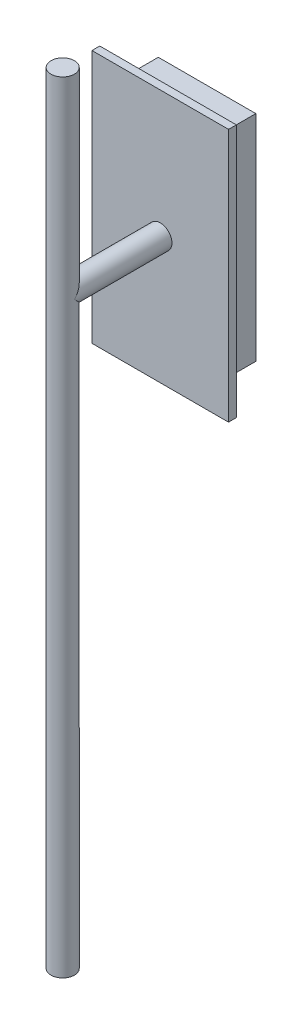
from build123d import *

# Parameters (mm, degrees)
CROQUIS1_W                   = 70
CROQUIS1_H                   = 130
SALIENTE_EXTRUIR1_DEPTH      = 4
CROQUIS2_W                   = 50
CROQUIS2_H                   = 110
SALIENTE_EXTRUIR2_DEPTH      = 20
CROQUIS3_R                   = 6
SALIENTE_EXTRUIR3_DEPTH      = 50
SALIENTE_EXTRUIR4_DEPTH      = 100
SALIENTE_EXTRUIR4_DEPTH_BACK = 300
CROQUIS4_R                   = 6


with BuildPart() as part:
    # Croquis1 → Saliente-Extruir1 (new body)
    with BuildSketch(Plane.XY):
        Rectangle(CROQUIS1_W, CROQUIS1_H)
    extrude(amount=SALIENTE_EXTRUIR1_DEPTH)

    # Croquis2 → Saliente-Extruir2 (add)
    with BuildSketch(Plane(origin=(0, 0, 0), x_dir=(-1, 0, 0), z_dir=(0, 0, -1))):
        Rectangle(CROQUIS2_W, CROQUIS2_H)
    extrude(amount=SALIENTE_EXTRUIR2_DEPTH)

    # Croquis3 → Saliente-Extruir3 (add)
    with BuildSketch(Plane.XY.offset(4)):
        with Locations(Location((0, 0, 0), (0, 0, 180))):
            Circle(CROQUIS3_R)
    extrude(amount=SALIENTE_EXTRUIR3_DEPTH)

    # Croquis4 → Saliente-Extruir4 (add, two sides: drawn at the far end of the back side and taken through both)
    with BuildSketch(Plane(origin=(0, 0, 0), x_dir=(1, 0, 0), z_dir=(0, 1, 0)).offset(-SALIENTE_EXTRUIR4_DEPTH_BACK)):
        with Locations(Location((0, -54, 0), (0, 0, 270))):
            Circle(CROQUIS4_R)
    extrude(amount=SALIENTE_EXTRUIR4_DEPTH + SALIENTE_EXTRUIR4_DEPTH_BACK)


solid = part.part
